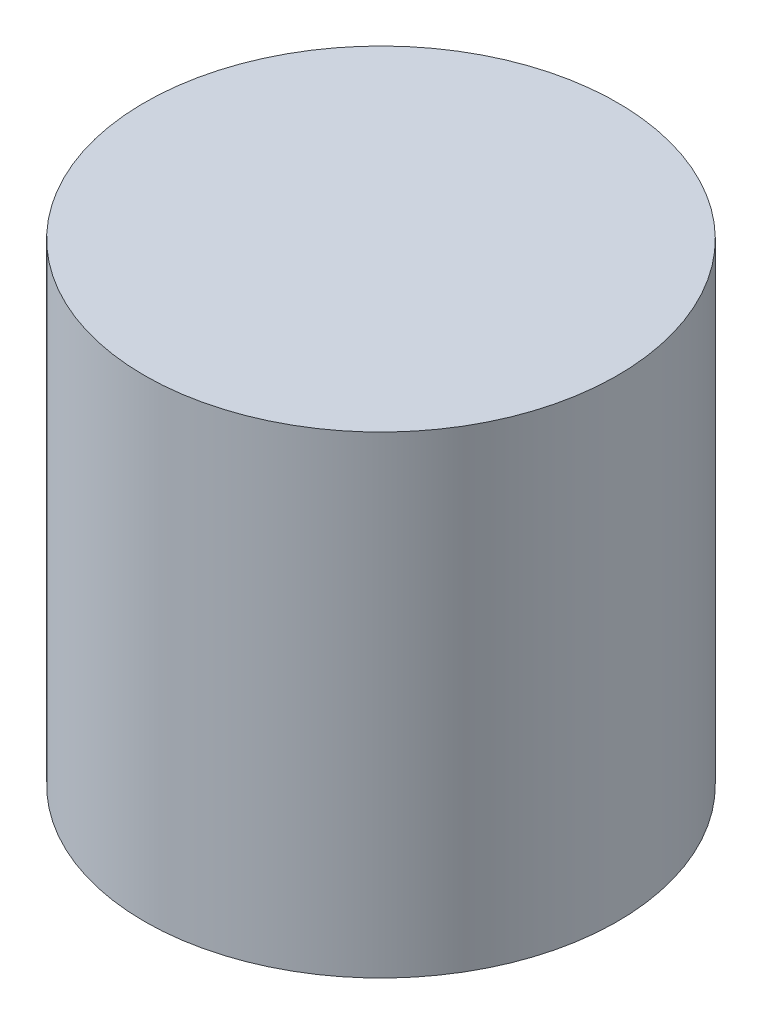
ISO-10303-21;
HEADER;
FILE_DESCRIPTION(('STEP AP214'),'2;1');
FILE_NAME('part.step','',(''),(''),'','','');
FILE_SCHEMA(('AUTOMOTIVE_DESIGN { 1 0 10303 214 1 1 1 1 }'));
ENDSEC;
DATA;
#1=APPLICATION_CONTEXT('core data for automotive mechanical design processes');
#2=APPLICATION_PROTOCOL_DEFINITION('international standard','automotive_design',2000,#1);
#3=PRODUCT_CONTEXT('',#1,'mechanical');
#4=PRODUCT('Part','Part','',(#3));
#5=PRODUCT_RELATED_PRODUCT_CATEGORY('part','',(#4));
#6=PRODUCT_DEFINITION_FORMATION('','',#4);
#7=PRODUCT_DEFINITION_CONTEXT('part definition',#1,'design');
#8=PRODUCT_DEFINITION('design','',#6,#7);
#9=PRODUCT_DEFINITION_SHAPE('','',#8);
#10=(LENGTH_UNIT() NAMED_UNIT(*) SI_UNIT(.MILLI.,.METRE.));
#11=(NAMED_UNIT(*) PLANE_ANGLE_UNIT() SI_UNIT($,.RADIAN.));
#12=(NAMED_UNIT(*) SI_UNIT($,.STERADIAN.) SOLID_ANGLE_UNIT());
#13=UNCERTAINTY_MEASURE_WITH_UNIT(LENGTH_MEASURE(1.E-05),#10,'distance_accuracy_value','');
#14=(GEOMETRIC_REPRESENTATION_CONTEXT(3) GLOBAL_UNCERTAINTY_ASSIGNED_CONTEXT((#13)) GLOBAL_UNIT_ASSIGNED_CONTEXT((#10,
#11,#12)) REPRESENTATION_CONTEXT('',''));
#15=CARTESIAN_POINT('',(0.,0.,0.));
#16=DIRECTION('',(0.,0.,1.));
#17=DIRECTION('',(1.,0.,0.));
#18=AXIS2_PLACEMENT_3D('',#15,#16,#17);
#19=CARTESIAN_POINT('',(0.,12.7,0.));
#20=DIRECTION('',(0.,-1.,0.));
#21=DIRECTION('',(0.,0.,-1.));
#22=AXIS2_PLACEMENT_3D('',#19,#20,#21);
#23=CYLINDRICAL_SURFACE('',#22,6.35);
#24=CARTESIAN_POINT('',(0.,12.7,0.));
#25=DIRECTION('',(0.,1.,0.));
#26=DIRECTION('',(0.,0.,1.));
#27=AXIS2_PLACEMENT_3D('',#24,#25,#26);
#28=CIRCLE('',#27,6.35);
#29=CARTESIAN_POINT('',(0.,12.7,6.35));
#30=VERTEX_POINT('',#29);
#31=EDGE_CURVE('E10',#30,#30,#28,.T.);
#32=ORIENTED_EDGE('',*,*,#31,.F.);
#33=EDGE_LOOP('',(#32));
#34=FACE_BOUND('',#33,.T.);
#35=CARTESIAN_POINT('',(0.,0.,0.));
#36=DIRECTION('',(0.,1.,0.));
#37=DIRECTION('',(0.,0.,1.));
#38=AXIS2_PLACEMENT_3D('',#35,#36,#37);
#39=CIRCLE('',#38,6.35);
#40=CARTESIAN_POINT('',(0.,0.,6.35));
#41=VERTEX_POINT('',#40);
#42=EDGE_CURVE('E34',#41,#41,#39,.T.);
#43=ORIENTED_EDGE('',*,*,#42,.T.);
#44=EDGE_LOOP('',(#43));
#45=FACE_BOUND('',#44,.T.);
#46=ADVANCED_FACE('F31',(#34,#45),#23,.T.);
#47=CARTESIAN_POINT('',(0.,12.7,0.));
#48=DIRECTION('',(0.,1.,0.));
#49=DIRECTION('',(0.,0.,1.));
#50=AXIS2_PLACEMENT_3D('',#47,#48,#49);
#51=PLANE('',#50);
#52=ORIENTED_EDGE('',*,*,#31,.T.);
#53=EDGE_LOOP('',(#52));
#54=FACE_BOUND('',#53,.T.);
#55=ADVANCED_FACE('F46',(#54),#51,.T.);
#56=CARTESIAN_POINT('',(0.,0.,0.));
#57=DIRECTION('',(0.,1.,0.));
#58=DIRECTION('',(0.,0.,1.));
#59=AXIS2_PLACEMENT_3D('',#56,#57,#58);
#60=PLANE('',#59);
#61=ORIENTED_EDGE('',*,*,#42,.F.);
#62=EDGE_LOOP('',(#61));
#63=FACE_BOUND('',#62,.T.);
#64=ADVANCED_FACE('F44',(#63),#60,.F.);
#65=CLOSED_SHELL('',(#46,#55,#64));
#66=MANIFOLD_SOLID_BREP('B2',#65);
#67=ADVANCED_BREP_SHAPE_REPRESENTATION('',(#18,#66),#14);
#68=SHAPE_DEFINITION_REPRESENTATION(#9,#67);
ENDSEC;
END-ISO-10303-21;
